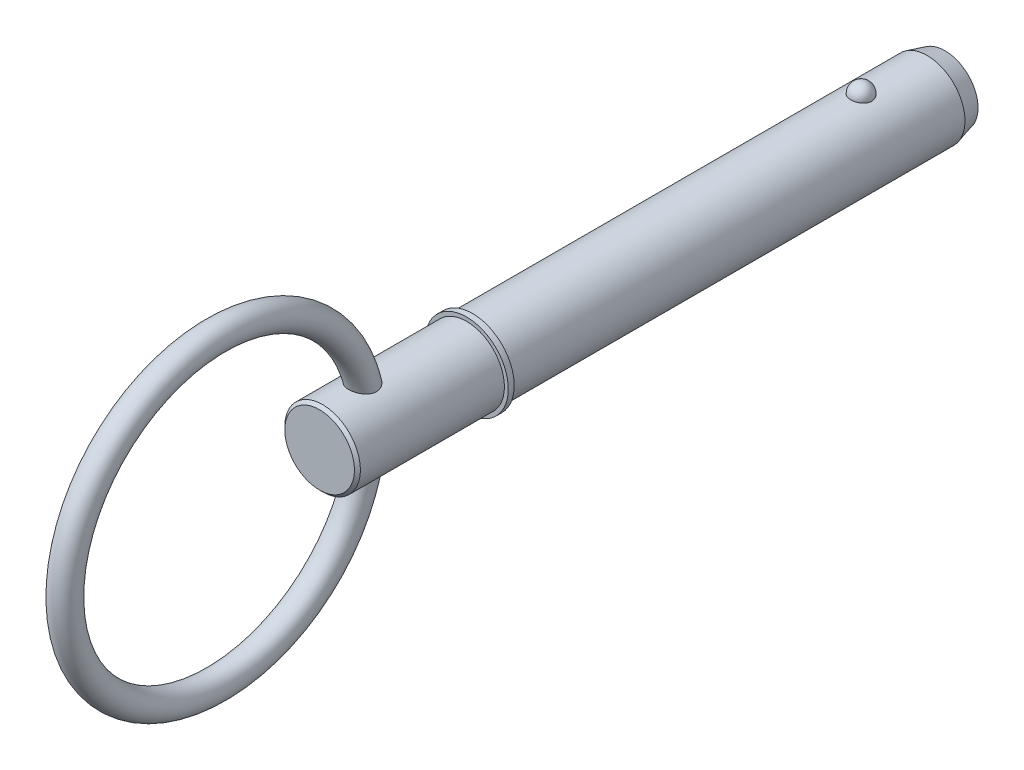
ISO-10303-21;
HEADER;
FILE_DESCRIPTION(('STEP AP214'),'2;1');
FILE_NAME('part.step','',(''),(''),'','','');
FILE_SCHEMA(('AUTOMOTIVE_DESIGN { 1 0 10303 214 1 1 1 1 }'));
ENDSEC;
DATA;
#1=APPLICATION_CONTEXT('core data for automotive mechanical design processes');
#2=APPLICATION_PROTOCOL_DEFINITION('international standard','automotive_design',2000,#1);
#3=PRODUCT_CONTEXT('',#1,'mechanical');
#4=PRODUCT('Part','Part','',(#3));
#5=PRODUCT_RELATED_PRODUCT_CATEGORY('part','',(#4));
#6=PRODUCT_DEFINITION_FORMATION('','',#4);
#7=PRODUCT_DEFINITION_CONTEXT('part definition',#1,'design');
#8=PRODUCT_DEFINITION('design','',#6,#7);
#9=PRODUCT_DEFINITION_SHAPE('','',#8);
#10=(LENGTH_UNIT() NAMED_UNIT(*) SI_UNIT(.MILLI.,.METRE.));
#11=(NAMED_UNIT(*) PLANE_ANGLE_UNIT() SI_UNIT($,.RADIAN.));
#12=(NAMED_UNIT(*) SI_UNIT($,.STERADIAN.) SOLID_ANGLE_UNIT());
#13=UNCERTAINTY_MEASURE_WITH_UNIT(LENGTH_MEASURE(1.E-05),#10,'distance_accuracy_value','');
#14=(GEOMETRIC_REPRESENTATION_CONTEXT(3) GLOBAL_UNCERTAINTY_ASSIGNED_CONTEXT((#13)) GLOBAL_UNIT_ASSIGNED_CONTEXT((#10,
#11,#12)) REPRESENTATION_CONTEXT('',''));
#15=CARTESIAN_POINT('',(0.,0.,0.));
#16=DIRECTION('',(0.,0.,1.));
#17=DIRECTION('',(1.,0.,0.));
#18=AXIS2_PLACEMENT_3D('',#15,#16,#17);
#19=CARTESIAN_POINT('',(0.,0.,63.5));
#20=DIRECTION('',(0.,0.,-1.));
#21=DIRECTION('',(-1.,0.,0.));
#22=AXIS2_PLACEMENT_3D('',#19,#20,#21);
#23=CYLINDRICAL_SURFACE('',#22,6.35);
#24=CARTESIAN_POINT('',(1.76243001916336,6.10051968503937,-1.78));
#25=CARTESIAN_POINT('',(1.76242835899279,6.10052111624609,-1.68050311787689));
#26=CARTESIAN_POINT('',(1.75431593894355,6.1028816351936,-1.58098521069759));
#27=CARTESIAN_POINT('',(1.72206027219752,6.11206037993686,-1.38476972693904));
#28=CARTESIAN_POINT('',(1.69791106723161,6.11888026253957,-1.28807321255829));
#29=CARTESIAN_POINT('',(1.63419596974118,6.13620287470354,-1.10029899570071));
#30=CARTESIAN_POINT('',(1.59463684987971,6.14670398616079,-1.00921884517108));
#31=CARTESIAN_POINT('',(1.50108569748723,6.17021534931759,-0.835161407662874));
#32=CARTESIAN_POINT('',(1.44709398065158,6.18322554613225,-0.752183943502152));
#33=CARTESIAN_POINT('',(1.3257243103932,6.21038081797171,-0.596209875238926));
#34=CARTESIAN_POINT('',(1.2582815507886,6.22453118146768,-0.523264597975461));
#35=CARTESIAN_POINT('',(1.11191624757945,6.25233390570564,-0.389855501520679));
#36=CARTESIAN_POINT('',(1.03299369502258,6.26598626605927,-0.329391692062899));
#37=CARTESIAN_POINT('',(0.866022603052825,6.29123226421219,-0.222793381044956));
#38=CARTESIAN_POINT('',(0.778000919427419,6.30283170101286,-0.176618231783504));
#39=CARTESIAN_POINT('',(0.59510847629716,6.32272058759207,-0.0996905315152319));
#40=CARTESIAN_POINT('',(0.500238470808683,6.33101040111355,-0.0689362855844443));
#41=CARTESIAN_POINT('',(0.308164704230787,6.34323464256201,-0.0241595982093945));
#42=CARTESIAN_POINT('',(0.211033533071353,6.34724467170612,-0.00984637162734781));
#43=CARTESIAN_POINT('',(0.0156629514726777,6.3507318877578,0.00262058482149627));
#44=CARTESIAN_POINT('',(-0.0825763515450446,6.35020951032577,0.000775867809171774));
#45=CARTESIAN_POINT('',(-0.275890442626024,6.34473055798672,-0.018872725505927));
#46=CARTESIAN_POINT('',(-0.370990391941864,6.3398374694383,-0.0364481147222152));
#47=CARTESIAN_POINT('',(-0.556805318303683,6.32622723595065,-0.0867447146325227));
#48=CARTESIAN_POINT('',(-0.647520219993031,6.31751002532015,-0.119466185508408));
#49=CARTESIAN_POINT('',(-0.822606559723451,6.29711353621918,-0.199386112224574));
#50=CARTESIAN_POINT('',(-0.906938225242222,6.28541739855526,-0.246667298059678));
#51=CARTESIAN_POINT('',(-1.06646479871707,6.26032612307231,-0.354365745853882));
#52=CARTESIAN_POINT('',(-1.14165877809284,6.24693081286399,-0.414784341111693));
#53=CARTESIAN_POINT('',(-1.2823514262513,6.21959142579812,-0.548435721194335));
#54=CARTESIAN_POINT('',(-1.34763761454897,6.2056417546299,-0.621891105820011));
#55=CARTESIAN_POINT('',(-1.4651153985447,6.17896241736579,-0.778815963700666));
#56=CARTESIAN_POINT('',(-1.51730606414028,6.16623283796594,-0.862286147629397));
#57=CARTESIAN_POINT('',(-1.60782211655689,6.14325839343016,-1.0379915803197));
#58=CARTESIAN_POINT('',(-1.64598111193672,6.13304379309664,-1.13031660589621));
#59=CARTESIAN_POINT('',(-1.70661885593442,6.11644899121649,-1.32030667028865));
#60=CARTESIAN_POINT('',(-1.72909805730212,6.11006867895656,-1.41797155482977));
#61=CARTESIAN_POINT('',(-1.75775019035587,6.1018881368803,-1.61543246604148));
#62=CARTESIAN_POINT('',(-1.76399136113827,6.10006874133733,-1.71521779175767));
#63=CARTESIAN_POINT('',(-1.76020715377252,6.10116172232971,-1.91445126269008));
#64=CARTESIAN_POINT('',(-1.75018221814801,6.10407397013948,-2.01389941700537));
#65=CARTESIAN_POINT('',(-1.71421005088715,6.11427232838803,-2.20912106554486));
#66=CARTESIAN_POINT('',(-1.68834262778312,6.12153651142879,-2.30491043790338));
#67=CARTESIAN_POINT('',(-1.62139543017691,6.1396067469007,-2.49066180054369));
#68=CARTESIAN_POINT('',(-1.5803150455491,6.15041294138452,-2.58062355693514));
#69=CARTESIAN_POINT('',(-1.48369112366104,6.17443456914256,-2.75271428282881));
#70=CARTESIAN_POINT('',(-1.42806998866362,6.18766281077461,-2.83479789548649));
#71=CARTESIAN_POINT('',(-1.30386620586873,6.21501934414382,-2.98832532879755));
#72=CARTESIAN_POINT('',(-1.23528306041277,6.22914767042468,-3.05976874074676));
#73=CARTESIAN_POINT('',(-1.08663999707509,6.25679135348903,-3.19029656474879));
#74=CARTESIAN_POINT('',(-1.00653826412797,6.27030422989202,-3.24933392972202));
#75=CARTESIAN_POINT('',(-0.837212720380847,6.29514770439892,-3.35304657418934));
#76=CARTESIAN_POINT('',(-0.747989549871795,6.30647845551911,-3.39772286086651));
#77=CARTESIAN_POINT('',(-0.564098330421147,6.32556124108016,-3.47096393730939));
#78=CARTESIAN_POINT('',(-0.469512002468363,6.33335611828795,-3.49972259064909));
#79=CARTESIAN_POINT('',(-0.27663389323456,6.34470628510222,-3.54113722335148));
#80=CARTESIAN_POINT('',(-0.17834256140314,6.34826208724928,-3.55379514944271));
#81=CARTESIAN_POINT('',(0.0171660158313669,6.35071525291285,-3.56255473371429));
#82=CARTESIAN_POINT('',(0.114368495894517,6.34969931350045,-3.55896450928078));
#83=CARTESIAN_POINT('',(0.306746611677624,6.34331695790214,-3.53603383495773));
#84=CARTESIAN_POINT('',(0.401922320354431,6.33795069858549,-3.51669395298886));
#85=CARTESIAN_POINT('',(0.587203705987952,6.32347219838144,-3.4629173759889));
#86=CARTESIAN_POINT('',(0.677327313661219,6.31437430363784,-3.42853846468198));
#87=CARTESIAN_POINT('',(0.850462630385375,6.29339543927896,-3.34564128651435));
#88=CARTESIAN_POINT('',(0.933473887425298,6.2815142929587,-3.29712212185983));
#89=CARTESIAN_POINT('',(1.09144542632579,6.25601750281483,-3.18638742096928));
#90=CARTESIAN_POINT('',(1.16626195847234,6.24237795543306,-3.12397237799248));
#91=CARTESIAN_POINT('',(1.304448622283,6.21497285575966,-2.98755865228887));
#92=CARTESIAN_POINT('',(1.36781676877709,6.20120728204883,-2.91355796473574));
#93=CARTESIAN_POINT('',(1.48252779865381,6.17479923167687,-2.75456133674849));
#94=CARTESIAN_POINT('',(1.53364167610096,6.16218052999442,-2.66939613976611));
#95=CARTESIAN_POINT('',(1.62109397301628,6.13975602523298,-2.49147502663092));
#96=CARTESIAN_POINT('',(1.657437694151,6.12994921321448,-2.39872184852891));
#97=CARTESIAN_POINT('',(1.71127844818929,6.11512175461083,-2.21887622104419));
#98=CARTESIAN_POINT('',(1.73042646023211,6.10968903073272,-2.13230770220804));
#99=CARTESIAN_POINT('',(1.75600284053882,6.10238739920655,-1.95716498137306));
#100=CARTESIAN_POINT('',(1.76243149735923,6.10051841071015,-1.86859082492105));
#101=CARTESIAN_POINT('',(1.76243001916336,6.10051968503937,-1.78));
#102=B_SPLINE_CURVE_WITH_KNOTS('',3,(#24,#25,#26,#27,#28,#29,#30,#31,#32,#33,#34,#35,#36,#37,
#38,#39,#40,#41,#42,#43,#44,#45,#46,#47,#48,#49,#50,#51,#52,#53,#54,#55,#56,#57,#58,#59,#60,#61,
#62,#63,#64,#65,#66,#67,#68,#69,#70,#71,#72,#73,#74,#75,#76,#77,#78,#79,#80,#81,#82,#83,#84,#85,
#86,#87,#88,#89,#90,#91,#92,#93,#94,#95,#96,#97,#98,#99,#100,#101),.UNSPECIFIED.,.T.,.F.,(4,2,2,
2,2,2,2,2,2,2,2,2,2,2,2,2,2,2,2,2,2,2,2,2,2,2,2,2,2,2,2,2,2,2,2,2,2,2,4),(0.,0.298172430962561,
0.596455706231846,0.894608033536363,1.19275383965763,1.49237238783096,1.79199116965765,
2.09074960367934,2.38947519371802,2.68283180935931,2.97616022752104,3.26529599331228,
3.5544367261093,3.84525169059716,4.13609618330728,4.43249276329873,4.72891038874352,
5.02873757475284,5.32855610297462,5.62711261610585,5.92566100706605,6.22271765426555,
6.519786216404,6.81847366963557,7.11717259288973,7.41698459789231,7.71677557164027,
8.01283014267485,8.30884891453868,8.59927798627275,8.88969658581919,9.17900899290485,
9.46833977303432,9.76212836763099,10.0559678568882,10.3549321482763,10.6537890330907,
10.9192841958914,11.1847733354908),.UNSPECIFIED.);
#103=CARTESIAN_POINT('',(1.76243001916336,6.10051968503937,-1.78));
#104=VERTEX_POINT('',#103);
#105=EDGE_CURVE('E102',#104,#104,#102,.T.);
#106=ORIENTED_EDGE('',*,*,#105,.T.);
#107=EDGE_LOOP('',(#106));
#108=FACE_BOUND('',#107,.T.);
#109=CARTESIAN_POINT('',(0.,0.,-12.88));
#110=DIRECTION('',(0.,0.,-1.));
#111=DIRECTION('',(-1.,0.,0.));
#112=AXIS2_PLACEMENT_3D('',#109,#110,#111);
#113=CIRCLE('',#112,6.35);
#114=CARTESIAN_POINT('',(-6.35,0.,-12.88));
#115=VERTEX_POINT('',#114);
#116=EDGE_CURVE('E109',#115,#115,#113,.F.);
#117=ORIENTED_EDGE('',*,*,#116,.T.);
#118=EDGE_LOOP('',(#117));
#119=FACE_BOUND('',#118,.T.);
#120=CARTESIAN_POINT('',(0.,0.,63.5));
#121=DIRECTION('',(0.,0.,1.));
#122=DIRECTION('',(1.,0.,0.));
#123=AXIS2_PLACEMENT_3D('',#120,#121,#122);
#124=CIRCLE('',#123,6.35);
#125=CARTESIAN_POINT('',(6.35,0.,63.5));
#126=VERTEX_POINT('',#125);
#127=EDGE_CURVE('E107',#126,#126,#124,.T.);
#128=ORIENTED_EDGE('',*,*,#127,.F.);
#129=EDGE_LOOP('',(#128));
#130=FACE_BOUND('',#129,.T.);
#131=ADVANCED_FACE('F39',(#108,#119,#130),#23,.T.);
#132=CARTESIAN_POINT('',(0.,0.,-15.88));
#133=DIRECTION('',(0.,0.,-1.));
#134=DIRECTION('',(-1.,0.,0.));
#135=AXIS2_PLACEMENT_3D('',#132,#133,#134);
#136=PLANE('',#135);
#137=CARTESIAN_POINT('',(0.,0.,-15.88));
#138=DIRECTION('',(0.,0.,-1.));
#139=DIRECTION('',(-1.,0.,0.));
#140=AXIS2_PLACEMENT_3D('',#137,#138,#139);
#141=CIRCLE('',#140,5.54615242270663);
#142=CARTESIAN_POINT('',(-5.54615242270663,0.,-15.88));
#143=VERTEX_POINT('',#142);
#144=EDGE_CURVE('E142',#143,#143,#141,.T.);
#145=ORIENTED_EDGE('',*,*,#144,.T.);
#146=EDGE_LOOP('',(#145));
#147=FACE_BOUND('',#146,.T.);
#148=ADVANCED_FACE('F88',(#147),#136,.T.);
#149=CARTESIAN_POINT('',(0.,0.,-15.88));
#150=DIRECTION('',(0.,0.,1.));
#151=DIRECTION('',(1.,0.,0.));
#152=AXIS2_PLACEMENT_3D('',#149,#150,#151);
#153=CONICAL_SURFACE('',#152,5.54615242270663,0.261799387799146);
#154=ORIENTED_EDGE('',*,*,#116,.F.);
#155=EDGE_LOOP('',(#154));
#156=FACE_BOUND('',#155,.T.);
#157=ORIENTED_EDGE('',*,*,#144,.F.);
#158=EDGE_LOOP('',(#157));
#159=FACE_BOUND('',#158,.T.);
#160=ADVANCED_FACE('F94',(#156,#159),#153,.T.);
#161=CARTESIAN_POINT('',(0.,6.35,-1.78));
#162=DIRECTION('',(0.,1.,0.));
#163=DIRECTION('',(0.,0.,1.));
#164=AXIS2_PLACEMENT_3D('',#161,#162,#163);
#165=SPHERICAL_SURFACE('',#164,1.78);
#166=ORIENTED_EDGE('',*,*,#105,.F.);
#167=EDGE_LOOP('',(#166));
#168=FACE_BOUND('',#167,.T.);
#169=ADVANCED_FACE('F112',(#168),#165,.T.);
#170=CARTESIAN_POINT('',(0.,0.,63.5));
#171=DIRECTION('',(0.,0.,-1.));
#172=DIRECTION('',(-1.,0.,0.));
#173=AXIS2_PLACEMENT_3D('',#170,#171,#172);
#174=PLANE('',#173);
#175=ORIENTED_EDGE('',*,*,#127,.T.);
#176=EDGE_LOOP('',(#175));
#177=FACE_BOUND('',#176,.T.);
#178=CARTESIAN_POINT('',(0.,0.,63.5));
#179=DIRECTION('',(0.,0.,-1.));
#180=DIRECTION('',(-1.,0.,0.));
#181=AXIS2_PLACEMENT_3D('',#178,#179,#180);
#182=CIRCLE('',#181,7.);
#183=CARTESIAN_POINT('',(-7.,0.,63.5));
#184=VERTEX_POINT('',#183);
#185=EDGE_CURVE('E108',#184,#184,#182,.T.);
#186=ORIENTED_EDGE('',*,*,#185,.T.);
#187=EDGE_LOOP('',(#186));
#188=FACE_BOUND('',#187,.T.);
#189=ADVANCED_FACE('F116',(#177,#188),#174,.T.);
#190=CARTESIAN_POINT('',(0.,0.,33.7287874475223));
#191=DIRECTION('',(0.,0.,-1.));
#192=DIRECTION('',(-1.,0.,0.));
#193=AXIS2_PLACEMENT_3D('',#190,#191,#192);
#194=CYLINDRICAL_SURFACE('',#193,7.);
#195=CARTESIAN_POINT('',(0.,0.,64.5));
#196=DIRECTION('',(0.,0.,-1.));
#197=DIRECTION('',(-1.,0.,0.));
#198=AXIS2_PLACEMENT_3D('',#195,#196,#197);
#199=CIRCLE('',#198,7.);
#200=CARTESIAN_POINT('',(-7.,0.,64.5));
#201=VERTEX_POINT('',#200);
#202=EDGE_CURVE('E133',#201,#201,#199,.T.);
#203=ORIENTED_EDGE('',*,*,#202,.T.);
#204=EDGE_LOOP('',(#203));
#205=FACE_BOUND('',#204,.T.);
#206=ORIENTED_EDGE('',*,*,#185,.F.);
#207=EDGE_LOOP('',(#206));
#208=FACE_BOUND('',#207,.T.);
#209=ADVANCED_FACE('F120',(#205,#208),#194,.T.);
#210=CARTESIAN_POINT('',(0.,7.,64.5));
#211=DIRECTION('',(0.,0.,1.));
#212=DIRECTION('',(1.,0.,0.));
#213=AXIS2_PLACEMENT_3D('',#210,#211,#212);
#214=PLANE('',#213);
#215=CARTESIAN_POINT('',(0.,0.,64.5));
#216=DIRECTION('',(0.,0.,1.));
#217=DIRECTION('',(1.,0.,0.));
#218=AXIS2_PLACEMENT_3D('',#215,#216,#217);
#219=CIRCLE('',#218,6.35);
#220=CARTESIAN_POINT('',(6.35,0.,64.5));
#221=VERTEX_POINT('',#220);
#222=EDGE_CURVE('E111',#221,#221,#219,.T.);
#223=ORIENTED_EDGE('',*,*,#222,.F.);
#224=EDGE_LOOP('',(#223));
#225=FACE_BOUND('',#224,.T.);
#226=ORIENTED_EDGE('',*,*,#202,.F.);
#227=EDGE_LOOP('',(#226));
#228=FACE_BOUND('',#227,.T.);
#229=ADVANCED_FACE('F85',(#225,#228),#214,.T.);
#230=CARTESIAN_POINT('',(0.,0.,89.2));
#231=DIRECTION('',(0.,0.,-1.));
#232=DIRECTION('',(-1.,0.,0.));
#233=AXIS2_PLACEMENT_3D('',#230,#231,#232);
#234=CYLINDRICAL_SURFACE('',#233,6.35);
#235=CARTESIAN_POINT('',(-1.08120660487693,-6.25727514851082,79.9515811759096));
#236=CARTESIAN_POINT('',(-0.970724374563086,-6.27636409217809,79.8938798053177));
#237=CARTESIAN_POINT('',(-0.855136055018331,-6.29329984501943,79.8452195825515));
#238=CARTESIAN_POINT('',(-0.616958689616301,-6.32109419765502,79.7670559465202));
#239=CARTESIAN_POINT('',(-0.494369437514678,-6.3319526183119,79.7375530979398));
#240=CARTESIAN_POINT('',(-0.245606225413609,-6.34647141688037,79.6983673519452));
#241=CARTESIAN_POINT('',(-0.119431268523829,-6.35012977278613,79.6886900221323));
#242=CARTESIAN_POINT('',(0.132849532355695,-6.34986313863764,79.6894002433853));
#243=CARTESIAN_POINT('',(0.258955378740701,-6.34593843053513,79.6997870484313));
#244=CARTESIAN_POINT('',(0.50691297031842,-6.33094785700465,79.7402854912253));
#245=CARTESIAN_POINT('',(0.628781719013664,-6.31991516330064,79.7703055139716));
#246=CARTESIAN_POINT('',(0.865486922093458,-6.29187143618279,79.8493088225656));
#247=CARTESIAN_POINT('',(0.980322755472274,-6.27485987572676,79.898293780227));
#248=CARTESIAN_POINT('',(1.20050616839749,-6.23649440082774,80.0145408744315));
#249=CARTESIAN_POINT('',(1.30578867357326,-6.21511352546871,80.0819174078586));
#250=CARTESIAN_POINT('',(1.50311440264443,-6.17036440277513,80.2333596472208));
#251=CARTESIAN_POINT('',(1.59515714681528,-6.14699608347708,80.3174259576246));
#252=CARTESIAN_POINT('',(1.76326863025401,-6.10090072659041,80.5002474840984));
#253=CARTESIAN_POINT('',(1.83935482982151,-6.07817301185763,80.5989864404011));
#254=CARTESIAN_POINT('',(1.97338559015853,-6.03599268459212,80.808703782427));
#255=CARTESIAN_POINT('',(2.03133638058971,-6.01653894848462,80.9196779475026));
#256=CARTESIAN_POINT('',(2.1259120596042,-5.98376466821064,81.147018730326));
#257=CARTESIAN_POINT('',(2.16315310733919,-5.97026970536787,81.2631040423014));
#258=CARTESIAN_POINT('',(2.21830650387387,-5.94999923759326,81.5003187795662));
#259=CARTESIAN_POINT('',(2.2362211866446,-5.94322292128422,81.6214475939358));
#260=CARTESIAN_POINT('',(2.25273772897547,-5.93698111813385,81.8632812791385));
#261=CARTESIAN_POINT('',(2.25163224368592,-5.93740484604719,81.9839640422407));
#262=CARTESIAN_POINT('',(2.23167546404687,-5.94493297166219,82.2236203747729));
#263=CARTESIAN_POINT('',(2.21281883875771,-5.9520393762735,82.3425934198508));
#264=CARTESIAN_POINT('',(2.15679576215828,-5.97257680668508,82.5838367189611));
#265=CARTESIAN_POINT('',(2.11851138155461,-5.98639144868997,82.7058128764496));
#266=CARTESIAN_POINT('',(2.02470263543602,-6.01876484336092,82.9422848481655));
#267=CARTESIAN_POINT('',(1.96916879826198,-6.03732620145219,83.0567765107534));
#268=CARTESIAN_POINT('',(1.8352662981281,-6.07945247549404,83.2879958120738));
#269=CARTESIAN_POINT('',(1.75507038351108,-6.10334207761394,83.4036110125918));
#270=CARTESIAN_POINT('',(1.57657889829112,-6.15186551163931,83.6198949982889));
#271=CARTESIAN_POINT('',(1.47827192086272,-6.17649980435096,83.7205542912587));
#272=CARTESIAN_POINT('',(1.26306696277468,-6.22410762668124,83.9050235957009));
#273=CARTESIAN_POINT('',(1.14585214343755,-6.24704086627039,83.9884783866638));
#274=CARTESIAN_POINT('',(0.896825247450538,-6.28760987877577,84.131400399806));
#275=CARTESIAN_POINT('',(0.765036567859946,-6.30525397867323,84.1909053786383));
#276=CARTESIAN_POINT('',(0.509454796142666,-6.330648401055,84.2752631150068));
#277=CARTESIAN_POINT('',(0.386964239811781,-6.33940909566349,84.3036959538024));
#278=CARTESIAN_POINT('',(0.200813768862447,-6.3471308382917,84.3286800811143));
#279=CARTESIAN_POINT('',(0.138353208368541,-6.34880140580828,84.334063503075));
#280=CARTESIAN_POINT('',(0.0131841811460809,-6.35029448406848,84.3388738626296));
#281=CARTESIAN_POINT('',(-0.04952425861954,-6.35011719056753,84.3383014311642));
#282=CARTESIAN_POINT('',(-0.219860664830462,-6.34710452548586,84.3285979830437));
#283=CARTESIAN_POINT('',(-0.327176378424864,-6.34243953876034,84.3135767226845));
#284=CARTESIAN_POINT('',(-0.537619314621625,-6.32808248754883,84.2666735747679));
#285=CARTESIAN_POINT('',(-0.640746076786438,-6.31838987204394,84.2347898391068));
#286=CARTESIAN_POINT('',(-0.841795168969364,-6.29478075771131,84.1553379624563));
#287=CARTESIAN_POINT('',(-0.939631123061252,-6.28081033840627,84.10756888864));
#288=CARTESIAN_POINT('',(-1.12690564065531,-6.2499288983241,83.9985138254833));
#289=CARTESIAN_POINT('',(-1.21634109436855,-6.2330167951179,83.937222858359));
#290=CARTESIAN_POINT('',(-1.39713031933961,-6.19517308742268,83.7940397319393));
#291=CARTESIAN_POINT('',(-1.48711596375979,-6.17400700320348,83.7104839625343));
#292=CARTESIAN_POINT('',(-1.65373642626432,-6.13148145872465,83.530996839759));
#293=CARTESIAN_POINT('',(-1.73036130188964,-6.11012186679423,83.4350563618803));
#294=CARTESIAN_POINT('',(-1.87908981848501,-6.06616529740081,83.2186208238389));
#295=CARTESIAN_POINT('',(-1.94902044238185,-6.04382072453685,83.0965721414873));
#296=CARTESIAN_POINT('',(-2.06849605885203,-6.00398244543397,82.8420700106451));
#297=CARTESIAN_POINT('',(-2.11803457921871,-5.98649027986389,82.7096132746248));
#298=CARTESIAN_POINT('',(-2.19551930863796,-5.95851933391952,82.4345936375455));
#299=CARTESIAN_POINT('',(-2.22297667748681,-5.94819998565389,82.2918743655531));
#300=CARTESIAN_POINT('',(-2.25222139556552,-5.93719450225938,82.0034800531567));
#301=CARTESIAN_POINT('',(-2.25403508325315,-5.93649848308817,81.8578081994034));
#302=CARTESIAN_POINT('',(-2.23178480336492,-5.94489150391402,81.5838044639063));
#303=CARTESIAN_POINT('',(-2.21035650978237,-5.95298402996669,81.4552268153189));
#304=CARTESIAN_POINT('',(-2.14565882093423,-5.97660650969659,81.2044089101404));
#305=CARTESIAN_POINT('',(-2.10239634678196,-5.99213410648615,81.0821666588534));
#306=CARTESIAN_POINT('',(-1.99913159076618,-6.02732890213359,80.8567478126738));
#307=CARTESIAN_POINT('',(-1.94060271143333,-6.04660536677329,80.7528298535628));
#308=CARTESIAN_POINT('',(-1.80736340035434,-6.0877569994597,80.556534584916));
#309=CARTESIAN_POINT('',(-1.73265259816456,-6.10963222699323,80.4641575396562));
#310=CARTESIAN_POINT('',(-1.56865095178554,-6.15378470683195,80.2926034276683));
#311=CARTESIAN_POINT('',(-1.47928749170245,-6.17606344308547,80.2134962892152));
#312=CARTESIAN_POINT('',(-1.28858731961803,-6.21864788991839,80.0706753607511));
#313=CARTESIAN_POINT('',(-1.18724893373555,-6.23895332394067,80.0069637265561));
#314=CARTESIAN_POINT('',(-1.08120660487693,-6.25727514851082,79.9515811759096));
#315=B_SPLINE_CURVE_WITH_KNOTS('',3,(#235,#236,#237,#238,#239,#240,#241,#242,#243,#244,#245,
#246,#247,#248,#249,#250,#251,#252,#253,#254,#255,#256,#257,#258,#259,#260,#261,#262,#263,#264,
#265,#266,#267,#268,#269,#270,#271,#272,#273,#274,#275,#276,#277,#278,#279,#280,#281,#282,#283,
#284,#285,#286,#287,#288,#289,#290,#291,#292,#293,#294,#295,#296,#297,#298,#299,#300,#301,#302,
#303,#304,#305,#306,#307,#308,#309,#310,#311,#312,#313,#314),.UNSPECIFIED.,.T.,.F.,(4,2,2,2,2,2,
2,2,2,2,2,2,2,2,2,2,2,2,2,2,2,2,2,2,2,2,2,2,2,2,2,2,2,2,2,2,2,2,2,4),(0.,0.377861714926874,
0.755734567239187,1.13371352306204,1.51167842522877,1.88789208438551,2.26413891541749,
2.64278156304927,3.02143792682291,3.39967776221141,3.77778752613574,4.14394628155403,
4.51006081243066,4.87054720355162,5.23114188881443,5.61534494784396,5.99975934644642,
6.42600522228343,6.85252048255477,7.28711365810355,7.72101899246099,8.0966613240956,
8.28452949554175,8.47237776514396,8.79607953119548,9.11981678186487,9.44781545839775,
9.77593508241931,10.1483085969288,10.5209580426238,10.9463240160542,11.3718248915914,
11.8065046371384,12.2407378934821,12.6304236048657,13.0199858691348,13.3807583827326,
13.7415391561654,14.104165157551,14.4668419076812),.UNSPECIFIED.);
#316=CARTESIAN_POINT('',(-1.08120660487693,-6.25727514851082,79.9515811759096));
#317=VERTEX_POINT('',#316);
#318=EDGE_CURVE('E10',#317,#317,#315,.T.);
#319=ORIENTED_EDGE('',*,*,#318,.F.);
#320=EDGE_LOOP('',(#319));
#321=FACE_BOUND('',#320,.T.);
#322=CARTESIAN_POINT('',(-1.08120660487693,6.25727514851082,79.9515811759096));
#323=CARTESIAN_POINT('',(-1.19093168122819,6.23831652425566,80.008887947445));
#324=CARTESIAN_POINT('',(-1.29562751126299,6.21723224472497,80.0751167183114));
#325=CARTESIAN_POINT('',(-1.49211272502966,6.17302620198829,80.224020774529));
#326=CARTESIAN_POINT('',(-1.58390200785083,6.14990442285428,80.3066961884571));
#327=CARTESIAN_POINT('',(-1.75209695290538,6.10411985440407,80.4867778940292));
#328=CARTESIAN_POINT('',(-1.82848346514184,6.08145766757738,80.5842022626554));
#329=CARTESIAN_POINT('',(-1.96346259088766,6.0392331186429,80.7912733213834));
#330=CARTESIAN_POINT('',(-2.02206050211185,6.01966983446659,80.9009163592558));
#331=CARTESIAN_POINT('',(-2.11860444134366,5.9863659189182,81.1265649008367));
#332=CARTESIAN_POINT('',(-2.15701637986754,5.97249571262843,81.2423519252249));
#333=CARTESIAN_POINT('',(-2.21449304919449,5.95142584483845,81.4791911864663));
#334=CARTESIAN_POINT('',(-2.23356015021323,5.94422536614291,81.6002427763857));
#335=CARTESIAN_POINT('',(-2.25228141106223,5.93715610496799,81.8419445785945));
#336=CARTESIAN_POINT('',(-2.25225786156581,5.93716560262,81.9625670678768));
#337=CARTESIAN_POINT('',(-2.2344206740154,5.94389982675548,82.2022777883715));
#338=CARTESIAN_POINT('',(-2.21660184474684,5.95062651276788,82.3213655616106));
#339=CARTESIAN_POINT('',(-2.16272689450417,5.97042554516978,82.5627056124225));
#340=CARTESIAN_POINT('',(-2.12559286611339,5.98387086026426,82.6846848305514));
#341=CARTESIAN_POINT('',(-2.03409944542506,6.0155857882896,82.921342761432));
#342=CARTESIAN_POINT('',(-1.97973080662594,6.03385799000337,83.0360175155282));
#343=CARTESIAN_POINT('',(-1.84828023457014,6.07549301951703,83.2678654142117));
#344=CARTESIAN_POINT('',(-1.76936622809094,6.09919386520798,83.3839437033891));
#345=CARTESIAN_POINT('',(-1.59344783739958,6.14749881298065,83.6014208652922));
#346=CARTESIAN_POINT('',(-1.49643151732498,6.17210350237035,83.7028099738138));
#347=CARTESIAN_POINT('',(-1.28333318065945,6.21994692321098,83.8895083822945));
#348=CARTESIAN_POINT('',(-1.16685721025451,6.24314005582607,83.9743845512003));
#349=CARTESIAN_POINT('',(-0.919062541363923,6.2843871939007,84.1203440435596));
#350=CARTESIAN_POINT('',(-0.787766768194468,6.30244898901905,84.1814634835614));
#351=CARTESIAN_POINT('',(-0.532335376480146,6.32876911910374,84.2691112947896));
#352=CARTESIAN_POINT('',(-0.409516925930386,6.33800211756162,84.2991235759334));
#353=CARTESIAN_POINT('',(-0.222636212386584,6.34640533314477,84.3263386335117));
#354=CARTESIAN_POINT('',(-0.15989383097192,6.34829860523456,84.3324428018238));
#355=CARTESIAN_POINT('',(-0.0340877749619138,6.35021985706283,84.3386341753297));
#356=CARTESIAN_POINT('',(0.0289758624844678,6.35024804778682,84.3387220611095));
#357=CARTESIAN_POINT('',(0.200008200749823,6.34776620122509,84.3307320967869));
#358=CARTESIAN_POINT('',(0.307730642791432,6.34342046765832,84.3167500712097));
#359=CARTESIAN_POINT('',(0.51913450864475,6.32963338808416,84.2717653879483));
#360=CARTESIAN_POINT('',(0.622815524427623,6.3201915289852,84.2407610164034));
#361=CARTESIAN_POINT('',(0.824580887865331,6.2970603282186,84.1630869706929));
#362=CARTESIAN_POINT('',(0.922611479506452,6.28333629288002,84.1162890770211));
#363=CARTESIAN_POINT('',(1.11039970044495,6.2528858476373,84.0091226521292));
#364=CARTESIAN_POINT('',(1.20015435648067,6.23615836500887,83.9487492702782));
#365=CARTESIAN_POINT('',(1.38155818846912,6.19866747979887,83.8076024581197));
#366=CARTESIAN_POINT('',(1.47187645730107,6.17766310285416,83.7251847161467));
#367=CARTESIAN_POINT('',(1.6393362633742,6.135352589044,83.5479469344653));
#368=CARTESIAN_POINT('',(1.71646809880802,6.11404624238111,83.4531178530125));
#369=CARTESIAN_POINT('',(1.86660460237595,6.07002946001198,83.238851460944));
#370=CARTESIAN_POINT('',(1.93743710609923,6.04755477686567,83.1178347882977));
#371=CARTESIAN_POINT('',(2.0589430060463,6.00727604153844,82.8652808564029));
#372=CARTESIAN_POINT('',(2.1096091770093,5.98947366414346,82.733739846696));
#373=CARTESIAN_POINT('',(2.18982014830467,5.96062717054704,82.4597589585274));
#374=CARTESIAN_POINT('',(2.21877575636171,5.94977267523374,82.3171236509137));
#375=CARTESIAN_POINT('',(2.2510475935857,5.93764416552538,82.0285958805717));
#376=CARTESIAN_POINT('',(2.25438985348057,5.93636042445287,81.8827068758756));
#377=CARTESIAN_POINT('',(2.23498011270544,5.9436885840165,81.6077311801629));
#378=CARTESIAN_POINT('',(2.21482640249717,5.95131530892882,81.4784341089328));
#379=CARTESIAN_POINT('',(2.15248760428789,5.97414352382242,81.2259695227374));
#380=CARTESIAN_POINT('',(2.11031020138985,5.98934237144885,81.1027998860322));
#381=CARTESIAN_POINT('',(2.00904610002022,6.02402214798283,80.8757832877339));
#382=CARTESIAN_POINT('',(1.95150192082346,6.04308594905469,80.7711789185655));
#383=CARTESIAN_POINT('',(1.82009972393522,6.08395083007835,80.5733823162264));
#384=CARTESIAN_POINT('',(1.74624088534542,6.10575204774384,80.4801906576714));
#385=CARTESIAN_POINT('',(1.58309476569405,6.15008431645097,80.3061646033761));
#386=CARTESIAN_POINT('',(1.49360904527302,6.17262128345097,80.2255180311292));
#387=CARTESIAN_POINT('',(1.30231515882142,6.21579297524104,80.0798366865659));
#388=CARTESIAN_POINT('',(1.20050521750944,6.23642742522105,80.0148041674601));
#389=CARTESIAN_POINT('',(0.98378657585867,6.27432316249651,79.8998596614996));
#390=CARTESIAN_POINT('',(0.868563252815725,6.29145558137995,79.8504972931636));
#391=CARTESIAN_POINT('',(0.630994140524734,6.31970327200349,79.7708857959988));
#392=CARTESIAN_POINT('',(0.508648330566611,6.33081852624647,79.7406367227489));
#393=CARTESIAN_POINT('',(0.259933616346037,6.34590352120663,79.6998795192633));
#394=CARTESIAN_POINT('',(0.133554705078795,6.34985380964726,79.6894251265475));
#395=CARTESIAN_POINT('',(-0.119270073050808,6.35013815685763,79.6886676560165));
#396=CARTESIAN_POINT('',(-0.245715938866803,6.34647233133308,79.6983642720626));
#397=CARTESIAN_POINT('',(-0.494670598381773,6.33192772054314,79.7376209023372));
#398=CARTESIAN_POINT('',(-0.617189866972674,6.3210701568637,79.7671224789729));
#399=CARTESIAN_POINT('',(-0.855240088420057,6.29328476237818,79.8452630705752));
#400=CARTESIAN_POINT('',(-0.970770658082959,6.27635659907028,79.8939031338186));
#401=CARTESIAN_POINT('',(-1.08120660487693,6.25727514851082,79.9515811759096));
#402=B_SPLINE_CURVE_WITH_KNOTS('',3,(#322,#323,#324,#325,#326,#327,#328,#329,#330,#331,#332,
#333,#334,#335,#336,#337,#338,#339,#340,#341,#342,#343,#344,#345,#346,#347,#348,#349,#350,#351,
#352,#353,#354,#355,#356,#357,#358,#359,#360,#361,#362,#363,#364,#365,#366,#367,#368,#369,#370,
#371,#372,#373,#374,#375,#376,#377,#378,#379,#380,#381,#382,#383,#384,#385,#386,#387,#388,#389,
#390,#391,#392,#393,#394,#395,#396,#397,#398,#399,#400,#401),.UNSPECIFIED.,.T.,.F.,(4,2,2,2,2,2,
2,2,2,2,2,2,2,2,2,2,2,2,2,2,2,2,2,2,2,2,2,2,2,2,2,2,2,2,2,2,2,2,2,4),(0.,0.375258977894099,
0.750520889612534,1.1262465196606,1.50186014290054,1.86837438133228,2.2348437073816,
2.59512638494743,2.95551419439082,3.33859924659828,3.7218901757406,4.14704029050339,
4.57247172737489,5.00788576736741,5.4426352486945,5.82040093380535,6.00932292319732,
6.19822354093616,6.52266071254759,6.84713055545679,7.17430063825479,7.50158780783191,
7.87233275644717,8.24334931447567,8.66748794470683,9.09177840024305,9.52720369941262,
9.96218641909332,10.3532895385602,10.7442562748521,11.1052784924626,11.4663188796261,
11.8323306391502,12.1983951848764,12.5761580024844,12.9539219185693,13.3327099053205,
13.7114921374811,14.0891615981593,14.4668517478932),.UNSPECIFIED.);
#403=CARTESIAN_POINT('',(-1.08120660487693,6.25727514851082,79.9515811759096));
#404=VERTEX_POINT('',#403);
#405=EDGE_CURVE('E51',#404,#404,#402,.T.);
#406=ORIENTED_EDGE('',*,*,#405,.F.);
#407=EDGE_LOOP('',(#406));
#408=FACE_BOUND('',#407,.T.);
#409=CARTESIAN_POINT('',(0.,0.,88.6999999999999));
#410=DIRECTION('',(0.,0.,-1.));
#411=DIRECTION('',(-1.,0.,0.));
#412=AXIS2_PLACEMENT_3D('',#409,#410,#411);
#413=CIRCLE('',#412,6.35);
#414=CARTESIAN_POINT('',(-6.35,0.,88.6999999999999));
#415=VERTEX_POINT('',#414);
#416=EDGE_CURVE('E64',#415,#415,#413,.T.);
#417=ORIENTED_EDGE('',*,*,#416,.T.);
#418=EDGE_LOOP('',(#417));
#419=FACE_BOUND('',#418,.T.);
#420=ORIENTED_EDGE('',*,*,#222,.T.);
#421=EDGE_LOOP('',(#420));
#422=FACE_BOUND('',#421,.T.);
#423=ADVANCED_FACE('F69',(#321,#408,#419,#422),#234,.T.);
#424=CARTESIAN_POINT('',(0.,0.,89.2));
#425=DIRECTION('',(0.,0.,-1.));
#426=DIRECTION('',(-1.,0.,0.));
#427=AXIS2_PLACEMENT_3D('',#424,#425,#426);
#428=PLANE('',#427);
#429=CARTESIAN_POINT('',(0.,0.,89.2));
#430=DIRECTION('',(0.,0.,-1.));
#431=DIRECTION('',(-1.,0.,0.));
#432=AXIS2_PLACEMENT_3D('',#429,#430,#431);
#433=CIRCLE('',#432,5.84999999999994);
#434=CARTESIAN_POINT('',(-5.84999999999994,0.,89.2));
#435=VERTEX_POINT('',#434);
#436=EDGE_CURVE('E58',#435,#435,#433,.F.);
#437=ORIENTED_EDGE('',*,*,#436,.T.);
#438=EDGE_LOOP('',(#437));
#439=FACE_BOUND('',#438,.T.);
#440=ADVANCED_FACE('F76',(#439),#428,.F.);
#441=CARTESIAN_POINT('',(0.,0.,88.6999999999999));
#442=DIRECTION('',(0.,0.,-1.));
#443=DIRECTION('',(-1.,0.,0.));
#444=AXIS2_PLACEMENT_3D('',#441,#442,#443);
#445=CONICAL_SURFACE('',#444,6.35,0.785398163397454);
#446=ORIENTED_EDGE('',*,*,#436,.F.);
#447=EDGE_LOOP('',(#446));
#448=FACE_BOUND('',#447,.T.);
#449=ORIENTED_EDGE('',*,*,#416,.F.);
#450=EDGE_LOOP('',(#449));
#451=FACE_BOUND('',#450,.T.);
#452=ADVANCED_FACE('F41',(#448,#451),#445,.T.);
#453=CARTESIAN_POINT('',(0.,0.,106.6));
#454=DIRECTION('',(1.,0.,0.));
#455=DIRECTION('',(0.,0.,-1.));
#456=AXIS2_PLACEMENT_3D('',#453,#454,#455);
#457=TOROIDAL_SURFACE('',#456,25.4,2.25);
#458=ORIENTED_EDGE('',*,*,#318,.T.);
#459=EDGE_LOOP('',(#458));
#460=FACE_BOUND('',#459,.T.);
#461=ORIENTED_EDGE('',*,*,#405,.T.);
#462=EDGE_LOOP('',(#461));
#463=FACE_BOUND('',#462,.T.);
#464=ADVANCED_FACE('F73',(#460,#463),#457,.T.);
#465=CLOSED_SHELL('',(#131,#148,#160,#169,#189,#209,#229,#423,#440,#452,#464));
#466=MANIFOLD_SOLID_BREP('B2',#465);
#467=ADVANCED_BREP_SHAPE_REPRESENTATION('',(#18,#466),#14);
#468=SHAPE_DEFINITION_REPRESENTATION(#9,#467);
ENDSEC;
END-ISO-10303-21;
